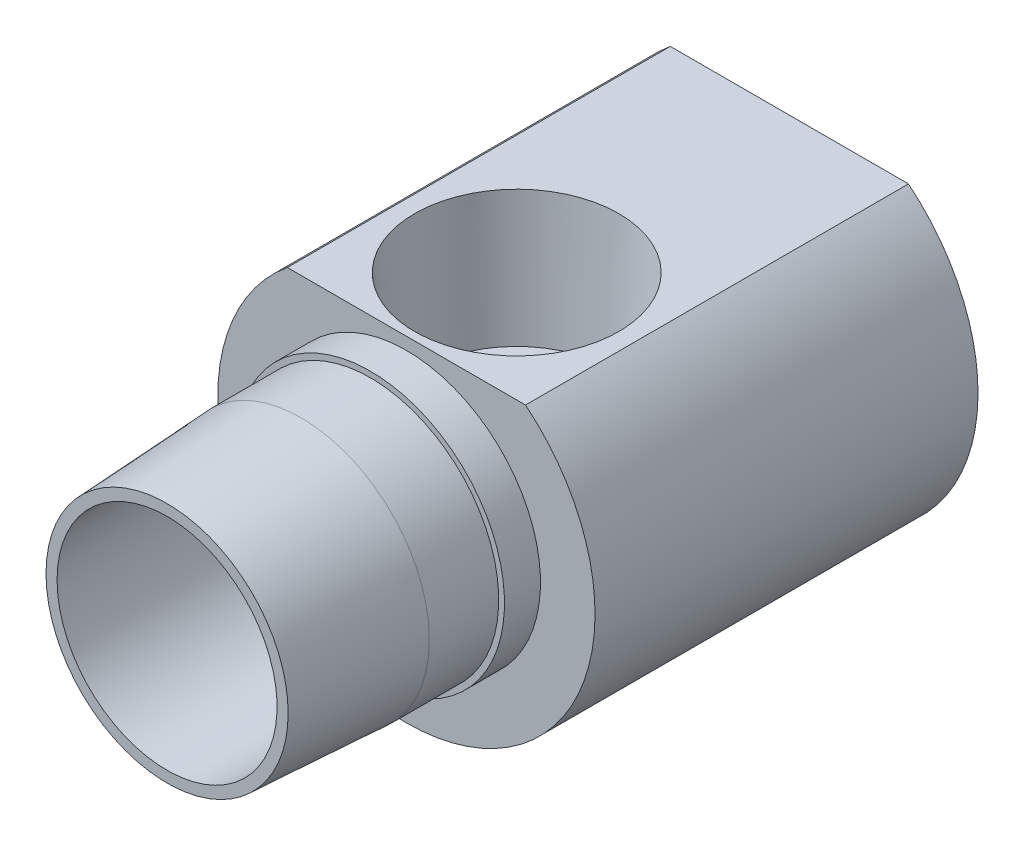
ISO-10303-21;
HEADER;
FILE_DESCRIPTION(('STEP AP214'),'2;1');
FILE_NAME('part.step','',(''),(''),'','','');
FILE_SCHEMA(('AUTOMOTIVE_DESIGN { 1 0 10303 214 1 1 1 1 }'));
ENDSEC;
DATA;
#1=APPLICATION_CONTEXT('core data for automotive mechanical design processes');
#2=APPLICATION_PROTOCOL_DEFINITION('international standard','automotive_design',2000,#1);
#3=PRODUCT_CONTEXT('',#1,'mechanical');
#4=PRODUCT('Part','Part','',(#3));
#5=PRODUCT_RELATED_PRODUCT_CATEGORY('part','',(#4));
#6=PRODUCT_DEFINITION_FORMATION('','',#4);
#7=PRODUCT_DEFINITION_CONTEXT('part definition',#1,'design');
#8=PRODUCT_DEFINITION('design','',#6,#7);
#9=PRODUCT_DEFINITION_SHAPE('','',#8);
#10=(LENGTH_UNIT() NAMED_UNIT(*) SI_UNIT(.MILLI.,.METRE.));
#11=(NAMED_UNIT(*) PLANE_ANGLE_UNIT() SI_UNIT($,.RADIAN.));
#12=(NAMED_UNIT(*) SI_UNIT($,.STERADIAN.) SOLID_ANGLE_UNIT());
#13=UNCERTAINTY_MEASURE_WITH_UNIT(LENGTH_MEASURE(1.E-05),#10,'distance_accuracy_value','');
#14=(GEOMETRIC_REPRESENTATION_CONTEXT(3) GLOBAL_UNCERTAINTY_ASSIGNED_CONTEXT((#13)) GLOBAL_UNIT_ASSIGNED_CONTEXT((#10,
#11,#12)) REPRESENTATION_CONTEXT('',''));
#15=CARTESIAN_POINT('',(0.,0.,0.));
#16=DIRECTION('',(0.,0.,1.));
#17=DIRECTION('',(1.,0.,0.));
#18=AXIS2_PLACEMENT_3D('',#15,#16,#17);
#19=CARTESIAN_POINT('',(-7.29488,0.,-13.462));
#20=DIRECTION('',(0.,0.,1.));
#21=DIRECTION('',(1.,0.,0.));
#22=AXIS2_PLACEMENT_3D('',#19,#20,#21);
#23=PLANE('',#22);
#24=CARTESIAN_POINT('',(0.,0.,-13.462));
#25=DIRECTION('',(0.,0.,-1.));
#26=DIRECTION('',(-1.,0.,0.));
#27=AXIS2_PLACEMENT_3D('',#24,#25,#26);
#28=CIRCLE('',#27,7.29488);
#29=CARTESIAN_POINT('',(-7.29488,0.,-13.462));
#30=VERTEX_POINT('',#29);
#31=EDGE_CURVE('E261',#30,#30,#28,.T.);
#32=ORIENTED_EDGE('',*,*,#31,.F.);
#33=EDGE_LOOP('',(#32));
#34=FACE_BOUND('',#33,.T.);
#35=CARTESIAN_POINT('',(0.,0.233282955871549,-13.462));
#36=DIRECTION('',(0.,0.,1.));
#37=DIRECTION('',(0.,1.,0.));
#38=AXIS2_PLACEMENT_3D('',#35,#36,#37);
#39=ELLIPSE('',#38,5.59241597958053,4.80582945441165);
#40=CARTESIAN_POINT('',(0.,5.82569893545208,-13.462));
#41=VERTEX_POINT('',#40);
#42=EDGE_CURVE('E264',#41,#41,#39,.F.);
#43=ORIENTED_EDGE('',*,*,#42,.T.);
#44=EDGE_LOOP('',(#43));
#45=FACE_BOUND('',#44,.T.);
#46=ADVANCED_FACE('F16',(#34,#45),#23,.T.);
#47=CARTESIAN_POINT('',(0.,0.,-8.89));
#48=DIRECTION('',(0.,0.,-1.));
#49=DIRECTION('',(-1.,0.,0.));
#50=AXIS2_PLACEMENT_3D('',#47,#48,#49);
#51=CONICAL_SURFACE('',#50,8.509,0.0538619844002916);
#52=CARTESIAN_POINT('',(0.,0.,0.));
#53=DIRECTION('',(0.,0.,-1.));
#54=DIRECTION('',(-1.,0.,0.));
#55=AXIS2_PLACEMENT_3D('',#52,#53,#54);
#56=CIRCLE('',#55,8.02970337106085);
#57=CARTESIAN_POINT('',(-8.02970337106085,0.,0.));
#58=VERTEX_POINT('',#57);
#59=EDGE_CURVE('E258',#58,#58,#56,.T.);
#60=ORIENTED_EDGE('',*,*,#59,.T.);
#61=EDGE_LOOP('',(#60));
#62=FACE_BOUND('',#61,.T.);
#63=CARTESIAN_POINT('',(0.,0.,-8.89));
#64=DIRECTION('',(0.,0.,-1.));
#65=DIRECTION('',(-1.,0.,0.));
#66=AXIS2_PLACEMENT_3D('',#63,#64,#65);
#67=CIRCLE('',#66,8.509);
#68=CARTESIAN_POINT('',(-8.509,0.,-8.89));
#69=VERTEX_POINT('',#68);
#70=EDGE_CURVE('E463',#69,#69,#67,.T.);
#71=ORIENTED_EDGE('',*,*,#70,.F.);
#72=EDGE_LOOP('',(#71));
#73=FACE_BOUND('',#72,.T.);
#74=ADVANCED_FACE('F18',(#62,#73),#51,.T.);
#75=CARTESIAN_POINT('',(-7.29488,0.,0.));
#76=DIRECTION('',(0.,0.,1.));
#77=DIRECTION('',(1.,0.,0.));
#78=AXIS2_PLACEMENT_3D('',#75,#76,#77);
#79=PLANE('',#78);
#80=CARTESIAN_POINT('',(0.,0.,0.));
#81=DIRECTION('',(0.,0.,-1.));
#82=DIRECTION('',(-1.,0.,0.));
#83=AXIS2_PLACEMENT_3D('',#80,#81,#82);
#84=CIRCLE('',#83,7.29488);
#85=CARTESIAN_POINT('',(-7.29488,0.,0.));
#86=VERTEX_POINT('',#85);
#87=EDGE_CURVE('E255',#86,#86,#84,.T.);
#88=ORIENTED_EDGE('',*,*,#87,.T.);
#89=EDGE_LOOP('',(#88));
#90=FACE_BOUND('',#89,.T.);
#91=ORIENTED_EDGE('',*,*,#59,.F.);
#92=EDGE_LOOP('',(#91));
#93=FACE_BOUND('',#92,.T.);
#94=ADVANCED_FACE('F242',(#90,#93),#79,.T.);
#95=CARTESIAN_POINT('',(0.,0.,-75.1971669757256));
#96=DIRECTION('',(0.,0.,-1.));
#97=DIRECTION('',(-1.,0.,0.));
#98=AXIS2_PLACEMENT_3D('',#95,#96,#97);
#99=CYLINDRICAL_SURFACE('',#98,7.29488);
#100=ORIENTED_EDGE('',*,*,#31,.T.);
#101=EDGE_LOOP('',(#100));
#102=FACE_BOUND('',#101,.T.);
#103=ORIENTED_EDGE('',*,*,#87,.F.);
#104=EDGE_LOOP('',(#103));
#105=FACE_BOUND('',#104,.T.);
#106=ADVANCED_FACE('F236',(#102,#105),#99,.F.);
#107=CARTESIAN_POINT('',(-12.5095,0.,-41.275));
#108=DIRECTION('',(0.,0.,-1.));
#109=DIRECTION('',(-1.,0.,0.));
#110=AXIS2_PLACEMENT_3D('',#107,#108,#109);
#111=PLANE('',#110);
#112=DIRECTION('',(1.,0.,0.));
#113=VECTOR('',#112,1.);
#114=CARTESIAN_POINT('',(-3.66617420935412,6.35,-41.275));
#115=LINE('',#114,#113);
#116=CARTESIAN_POINT('',(-3.66617420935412,6.35,-41.275));
#117=VERTEX_POINT('',#116);
#118=CARTESIAN_POINT('',(3.66617420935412,6.35,-41.275));
#119=VERTEX_POINT('',#118);
#120=EDGE_CURVE('E43',#117,#119,#115,.T.);
#121=ORIENTED_EDGE('',*,*,#120,.F.);
#122=DIRECTION('',(0.5,0.866025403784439,0.));
#123=VECTOR('',#122,1.);
#124=CARTESIAN_POINT('',(-7.33234841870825,0.,-41.275));
#125=LINE('',#124,#123);
#126=CARTESIAN_POINT('',(-7.33234841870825,0.,-41.275));
#127=VERTEX_POINT('',#126);
#128=EDGE_CURVE('E481',#127,#117,#125,.T.);
#129=ORIENTED_EDGE('',*,*,#128,.F.);
#130=DIRECTION('',(-0.5,0.866025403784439,0.));
#131=VECTOR('',#130,1.);
#132=CARTESIAN_POINT('',(-3.66617420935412,-6.35,-41.275));
#133=LINE('',#132,#131);
#134=CARTESIAN_POINT('',(-3.66617420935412,-6.35,-41.275));
#135=VERTEX_POINT('',#134);
#136=EDGE_CURVE('E485',#135,#127,#133,.T.);
#137=ORIENTED_EDGE('',*,*,#136,.F.);
#138=DIRECTION('',(-1.,0.,0.));
#139=VECTOR('',#138,1.);
#140=CARTESIAN_POINT('',(3.66617420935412,-6.35,-41.275));
#141=LINE('',#140,#139);
#142=CARTESIAN_POINT('',(3.66617420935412,-6.35,-41.275));
#143=VERTEX_POINT('',#142);
#144=EDGE_CURVE('E488',#143,#135,#141,.T.);
#145=ORIENTED_EDGE('',*,*,#144,.F.);
#146=DIRECTION('',(-0.5,-0.866025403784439,0.));
#147=VECTOR('',#146,1.);
#148=CARTESIAN_POINT('',(7.33234841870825,0.,-41.275));
#149=LINE('',#148,#147);
#150=CARTESIAN_POINT('',(7.33234841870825,0.,-41.275));
#151=VERTEX_POINT('',#150);
#152=EDGE_CURVE('E491',#151,#143,#149,.T.);
#153=ORIENTED_EDGE('',*,*,#152,.F.);
#154=DIRECTION('',(0.5,-0.866025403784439,0.));
#155=VECTOR('',#154,1.);
#156=CARTESIAN_POINT('',(3.66617420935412,6.35,-41.275));
#157=LINE('',#156,#155);
#158=EDGE_CURVE('E268',#119,#151,#157,.T.);
#159=ORIENTED_EDGE('',*,*,#158,.F.);
#160=EDGE_LOOP('',(#121,#129,#137,#145,#153,#159));
#161=FACE_BOUND('',#160,.T.);
#162=DIRECTION('',(-1.,0.,0.));
#163=VECTOR('',#162,1.);
#164=CARTESIAN_POINT('',(-7.8994,9.69984896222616,-41.275));
#165=LINE('',#164,#163);
#166=CARTESIAN_POINT('',(7.8994,9.69984896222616,-41.275));
#167=VERTEX_POINT('',#166);
#168=CARTESIAN_POINT('',(-7.8994,9.69984896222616,-41.275));
#169=VERTEX_POINT('',#168);
#170=EDGE_CURVE('E445',#167,#169,#165,.T.);
#171=ORIENTED_EDGE('',*,*,#170,.F.);
#172=CARTESIAN_POINT('',(0.,0.,-41.275));
#173=DIRECTION('',(0.,0.,-1.));
#174=DIRECTION('',(-1.,0.,0.));
#175=AXIS2_PLACEMENT_3D('',#172,#173,#174);
#176=CIRCLE('',#175,12.5095);
#177=EDGE_CURVE('E444',#167,#169,#176,.T.);
#178=ORIENTED_EDGE('',*,*,#177,.T.);
#179=EDGE_LOOP('',(#171,#178));
#180=FACE_BOUND('',#179,.T.);
#181=ADVANCED_FACE('F232',(#161,#180),#111,.T.);
#182=CARTESIAN_POINT('',(0.,0.,-75.1971669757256));
#183=DIRECTION('',(0.,0.,-1.));
#184=DIRECTION('',(-1.,0.,0.));
#185=AXIS2_PLACEMENT_3D('',#182,#183,#184);
#186=CYLINDRICAL_SURFACE('',#185,12.5095);
#187=DIRECTION('',(0.,0.,-1.));
#188=VECTOR('',#187,1.);
#189=CARTESIAN_POINT('',(-7.8994,9.69984896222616,0.));
#190=LINE('',#189,#188);
#191=CARTESIAN_POINT('',(-7.8994,9.69984896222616,-15.875));
#192=VERTEX_POINT('',#191);
#193=EDGE_CURVE('E438',#192,#169,#190,.T.);
#194=ORIENTED_EDGE('',*,*,#193,.T.);
#195=ORIENTED_EDGE('',*,*,#177,.F.);
#196=DIRECTION('',(0.,0.,-1.));
#197=VECTOR('',#196,1.);
#198=CARTESIAN_POINT('',(7.8994,9.69984896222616,0.));
#199=LINE('',#198,#197);
#200=CARTESIAN_POINT('',(7.8994,9.69984896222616,-15.875));
#201=VERTEX_POINT('',#200);
#202=EDGE_CURVE('E435',#201,#167,#199,.T.);
#203=ORIENTED_EDGE('',*,*,#202,.F.);
#204=CARTESIAN_POINT('',(0.,0.,-15.875));
#205=DIRECTION('',(0.,0.,-1.));
#206=DIRECTION('',(-1.,0.,0.));
#207=AXIS2_PLACEMENT_3D('',#204,#205,#206);
#208=CIRCLE('',#207,12.5095);
#209=EDGE_CURVE('E442',#201,#192,#208,.T.);
#210=ORIENTED_EDGE('',*,*,#209,.T.);
#211=EDGE_LOOP('',(#194,#195,#203,#210));
#212=FACE_BOUND('',#211,.T.);
#213=ADVANCED_FACE('F228',(#212),#186,.T.);
#214=CARTESIAN_POINT('',(-8.89,0.,-15.875));
#215=DIRECTION('',(0.,0.,1.));
#216=DIRECTION('',(1.,0.,0.));
#217=AXIS2_PLACEMENT_3D('',#214,#215,#216);
#218=PLANE('',#217);
#219=DIRECTION('',(1.,0.,0.));
#220=VECTOR('',#219,1.);
#221=CARTESIAN_POINT('',(-8.89,9.69984896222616,-15.875));
#222=LINE('',#221,#220);
#223=EDGE_CURVE('E117',#192,#201,#222,.T.);
#224=ORIENTED_EDGE('',*,*,#223,.F.);
#225=ORIENTED_EDGE('',*,*,#209,.F.);
#226=EDGE_LOOP('',(#224,#225));
#227=FACE_BOUND('',#226,.T.);
#228=CARTESIAN_POINT('',(0.,0.,-15.875));
#229=DIRECTION('',(0.,0.,-1.));
#230=DIRECTION('',(-1.,0.,0.));
#231=AXIS2_PLACEMENT_3D('',#228,#229,#230);
#232=CIRCLE('',#231,8.89);
#233=CARTESIAN_POINT('',(-8.89,0.,-15.875));
#234=VERTEX_POINT('',#233);
#235=EDGE_CURVE('E448',#234,#234,#232,.T.);
#236=ORIENTED_EDGE('',*,*,#235,.T.);
#237=EDGE_LOOP('',(#236));
#238=FACE_BOUND('',#237,.T.);
#239=ADVANCED_FACE('F224',(#227,#238),#218,.T.);
#240=CARTESIAN_POINT('',(0.,0.,-75.1971669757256));
#241=DIRECTION('',(0.,0.,-1.));
#242=DIRECTION('',(-1.,0.,0.));
#243=AXIS2_PLACEMENT_3D('',#240,#241,#242);
#244=CYLINDRICAL_SURFACE('',#243,8.89);
#245=CARTESIAN_POINT('',(0.,0.,-13.4874));
#246=DIRECTION('',(0.,0.,-1.));
#247=DIRECTION('',(-1.,0.,0.));
#248=AXIS2_PLACEMENT_3D('',#245,#246,#247);
#249=CIRCLE('',#248,8.89);
#250=CARTESIAN_POINT('',(-8.89,0.,-13.4874));
#251=VERTEX_POINT('',#250);
#252=EDGE_CURVE('E452',#251,#251,#249,.T.);
#253=ORIENTED_EDGE('',*,*,#252,.T.);
#254=EDGE_LOOP('',(#253));
#255=FACE_BOUND('',#254,.T.);
#256=ORIENTED_EDGE('',*,*,#235,.F.);
#257=EDGE_LOOP('',(#256));
#258=FACE_BOUND('',#257,.T.);
#259=ADVANCED_FACE('F220',(#255,#258),#244,.T.);
#260=CARTESIAN_POINT('',(-8.509,0.,-13.4874));
#261=DIRECTION('',(0.,0.,1.));
#262=DIRECTION('',(1.,0.,0.));
#263=AXIS2_PLACEMENT_3D('',#260,#261,#262);
#264=PLANE('',#263);
#265=CARTESIAN_POINT('',(0.,0.,-13.4874));
#266=DIRECTION('',(0.,0.,-1.));
#267=DIRECTION('',(-1.,0.,0.));
#268=AXIS2_PLACEMENT_3D('',#265,#266,#267);
#269=CIRCLE('',#268,8.509);
#270=CARTESIAN_POINT('',(-8.509,0.,-13.4874));
#271=VERTEX_POINT('',#270);
#272=EDGE_CURVE('E460',#271,#271,#269,.T.);
#273=ORIENTED_EDGE('',*,*,#272,.T.);
#274=EDGE_LOOP('',(#273));
#275=FACE_BOUND('',#274,.T.);
#276=ORIENTED_EDGE('',*,*,#252,.F.);
#277=EDGE_LOOP('',(#276));
#278=FACE_BOUND('',#277,.T.);
#279=ADVANCED_FACE('F216',(#275,#278),#264,.T.);
#280=CARTESIAN_POINT('',(0.,0.,-75.1971669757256));
#281=DIRECTION('',(0.,0.,-1.));
#282=DIRECTION('',(-1.,0.,0.));
#283=AXIS2_PLACEMENT_3D('',#280,#281,#282);
#284=CYLINDRICAL_SURFACE('',#283,8.509);
#285=ORIENTED_EDGE('',*,*,#70,.T.);
#286=EDGE_LOOP('',(#285));
#287=FACE_BOUND('',#286,.T.);
#288=ORIENTED_EDGE('',*,*,#272,.F.);
#289=EDGE_LOOP('',(#288));
#290=FACE_BOUND('',#289,.T.);
#291=ADVANCED_FACE('F212',(#287,#290),#284,.T.);
#292=CARTESIAN_POINT('',(-7.8994,9.69984896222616,0.));
#293=DIRECTION('',(0.,-1.,0.));
#294=DIRECTION('',(0.,0.,-1.));
#295=AXIS2_PLACEMENT_3D('',#292,#293,#294);
#296=PLANE('',#295);
#297=CARTESIAN_POINT('',(0.,9.69984896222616,-23.1902));
#298=DIRECTION('',(0.,-1.,0.));
#299=DIRECTION('',(0.,0.,-1.));
#300=AXIS2_PLACEMENT_3D('',#297,#298,#299);
#301=CIRCLE('',#300,6.774788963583);
#302=CARTESIAN_POINT('',(0.,9.69984896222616,-29.964988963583));
#303=VERTEX_POINT('',#302);
#304=EDGE_CURVE('E125',#303,#303,#301,.T.);
#305=ORIENTED_EDGE('',*,*,#304,.T.);
#306=EDGE_LOOP('',(#305));
#307=FACE_BOUND('',#306,.T.);
#308=ORIENTED_EDGE('',*,*,#223,.T.);
#309=ORIENTED_EDGE('',*,*,#202,.T.);
#310=ORIENTED_EDGE('',*,*,#170,.T.);
#311=ORIENTED_EDGE('',*,*,#193,.F.);
#312=EDGE_LOOP('',(#308,#309,#310,#311));
#313=FACE_BOUND('',#312,.T.);
#314=ADVANCED_FACE('F209',(#307,#313),#296,.F.);
#315=CARTESIAN_POINT('',(-3.66617420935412,6.35,-34.925));
#316=DIRECTION('',(0.,1.,0.));
#317=DIRECTION('',(-1.,0.,0.));
#318=AXIS2_PLACEMENT_3D('',#315,#316,#317);
#319=PLANE('',#318);
#320=ORIENTED_EDGE('',*,*,#120,.T.);
#321=DIRECTION('',(0.,0.,-1.));
#322=VECTOR('',#321,1.);
#323=CARTESIAN_POINT('',(3.66617420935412,6.35,-34.925));
#324=LINE('',#323,#322);
#325=CARTESIAN_POINT('',(3.66617420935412,6.35,-34.925));
#326=VERTEX_POINT('',#325);
#327=EDGE_CURVE('E469',#326,#119,#324,.T.);
#328=ORIENTED_EDGE('',*,*,#327,.F.);
#329=DIRECTION('',(1.,0.,0.));
#330=VECTOR('',#329,1.);
#331=CARTESIAN_POINT('',(-3.66617420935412,6.35,-34.925));
#332=LINE('',#331,#330);
#333=CARTESIAN_POINT('',(-3.66617420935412,6.35,-34.925));
#334=VERTEX_POINT('',#333);
#335=EDGE_CURVE('E484',#334,#326,#332,.T.);
#336=ORIENTED_EDGE('',*,*,#335,.F.);
#337=DIRECTION('',(0.,0.,-1.));
#338=VECTOR('',#337,1.);
#339=CARTESIAN_POINT('',(-3.66617420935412,6.35,-34.925));
#340=LINE('',#339,#338);
#341=EDGE_CURVE('E468',#334,#117,#340,.T.);
#342=ORIENTED_EDGE('',*,*,#341,.T.);
#343=EDGE_LOOP('',(#320,#328,#336,#342));
#344=FACE_BOUND('',#343,.T.);
#345=ADVANCED_FACE('F191',(#344),#319,.F.);
#346=CARTESIAN_POINT('',(-7.33234841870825,0.,-34.925));
#347=DIRECTION('',(-0.866025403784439,0.5,0.));
#348=DIRECTION('',(-0.5,-0.866025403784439,0.));
#349=AXIS2_PLACEMENT_3D('',#346,#347,#348);
#350=PLANE('',#349);
#351=ORIENTED_EDGE('',*,*,#128,.T.);
#352=ORIENTED_EDGE('',*,*,#341,.F.);
#353=DIRECTION('',(0.5,0.866025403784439,0.));
#354=VECTOR('',#353,1.);
#355=CARTESIAN_POINT('',(-7.33234841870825,0.,-34.925));
#356=LINE('',#355,#354);
#357=CARTESIAN_POINT('',(-7.33234841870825,0.,-34.925));
#358=VERTEX_POINT('',#357);
#359=EDGE_CURVE('E472',#358,#334,#356,.T.);
#360=ORIENTED_EDGE('',*,*,#359,.F.);
#361=DIRECTION('',(0.,0.,-1.));
#362=VECTOR('',#361,1.);
#363=CARTESIAN_POINT('',(-7.33234841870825,0.,-34.925));
#364=LINE('',#363,#362);
#365=EDGE_CURVE('E478',#358,#127,#364,.T.);
#366=ORIENTED_EDGE('',*,*,#365,.T.);
#367=EDGE_LOOP('',(#351,#352,#360,#366));
#368=FACE_BOUND('',#367,.T.);
#369=ADVANCED_FACE('F187',(#368),#350,.F.);
#370=CARTESIAN_POINT('',(-3.66617420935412,-6.35,-34.925));
#371=DIRECTION('',(-0.866025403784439,-0.5,0.));
#372=DIRECTION('',(0.5,-0.866025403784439,0.));
#373=AXIS2_PLACEMENT_3D('',#370,#371,#372);
#374=PLANE('',#373);
#375=ORIENTED_EDGE('',*,*,#136,.T.);
#376=ORIENTED_EDGE('',*,*,#365,.F.);
#377=DIRECTION('',(-0.5,0.866025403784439,0.));
#378=VECTOR('',#377,1.);
#379=CARTESIAN_POINT('',(-3.66617420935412,-6.35,-34.925));
#380=LINE('',#379,#378);
#381=CARTESIAN_POINT('',(-3.66617420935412,-6.35,-34.925));
#382=VERTEX_POINT('',#381);
#383=EDGE_CURVE('E498',#382,#358,#380,.T.);
#384=ORIENTED_EDGE('',*,*,#383,.F.);
#385=DIRECTION('',(0.,0.,-1.));
#386=VECTOR('',#385,1.);
#387=CARTESIAN_POINT('',(-3.66617420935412,-6.35,-34.925));
#388=LINE('',#387,#386);
#389=EDGE_CURVE('E476',#382,#135,#388,.T.);
#390=ORIENTED_EDGE('',*,*,#389,.T.);
#391=EDGE_LOOP('',(#375,#376,#384,#390));
#392=FACE_BOUND('',#391,.T.);
#393=ADVANCED_FACE('F190',(#392),#374,.F.);
#394=CARTESIAN_POINT('',(3.66617420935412,-6.35,-34.925));
#395=DIRECTION('',(0.,-1.,0.));
#396=DIRECTION('',(1.,0.,0.));
#397=AXIS2_PLACEMENT_3D('',#394,#395,#396);
#398=PLANE('',#397);
#399=ORIENTED_EDGE('',*,*,#144,.T.);
#400=ORIENTED_EDGE('',*,*,#389,.F.);
#401=DIRECTION('',(-1.,0.,0.));
#402=VECTOR('',#401,1.);
#403=CARTESIAN_POINT('',(3.66617420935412,-6.35,-34.925));
#404=LINE('',#403,#402);
#405=CARTESIAN_POINT('',(3.66617420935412,-6.35,-34.925));
#406=VERTEX_POINT('',#405);
#407=EDGE_CURVE('E501',#406,#382,#404,.T.);
#408=ORIENTED_EDGE('',*,*,#407,.F.);
#409=DIRECTION('',(0.,0.,-1.));
#410=VECTOR('',#409,1.);
#411=CARTESIAN_POINT('',(3.66617420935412,-6.35,-34.925));
#412=LINE('',#411,#410);
#413=EDGE_CURVE('E474',#406,#143,#412,.T.);
#414=ORIENTED_EDGE('',*,*,#413,.T.);
#415=EDGE_LOOP('',(#399,#400,#408,#414));
#416=FACE_BOUND('',#415,.T.);
#417=ADVANCED_FACE('F195',(#416),#398,.F.);
#418=CARTESIAN_POINT('',(7.33234841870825,0.,-34.925));
#419=DIRECTION('',(0.866025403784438,-0.5,0.));
#420=DIRECTION('',(0.5,0.866025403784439,0.));
#421=AXIS2_PLACEMENT_3D('',#418,#419,#420);
#422=PLANE('',#421);
#423=ORIENTED_EDGE('',*,*,#152,.T.);
#424=ORIENTED_EDGE('',*,*,#413,.F.);
#425=DIRECTION('',(-0.5,-0.866025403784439,0.));
#426=VECTOR('',#425,1.);
#427=CARTESIAN_POINT('',(7.33234841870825,0.,-34.925));
#428=LINE('',#427,#426);
#429=CARTESIAN_POINT('',(7.33234841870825,0.,-34.925));
#430=VERTEX_POINT('',#429);
#431=EDGE_CURVE('E504',#430,#406,#428,.T.);
#432=ORIENTED_EDGE('',*,*,#431,.F.);
#433=DIRECTION('',(0.,0.,-1.));
#434=VECTOR('',#433,1.);
#435=CARTESIAN_POINT('',(7.33234841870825,0.,-34.925));
#436=LINE('',#435,#434);
#437=EDGE_CURVE('E471',#430,#151,#436,.T.);
#438=ORIENTED_EDGE('',*,*,#437,.T.);
#439=EDGE_LOOP('',(#423,#424,#432,#438));
#440=FACE_BOUND('',#439,.T.);
#441=ADVANCED_FACE('F199',(#440),#422,.F.);
#442=CARTESIAN_POINT('',(3.66617420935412,6.35,-34.925));
#443=DIRECTION('',(0.866025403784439,0.5,0.));
#444=DIRECTION('',(-0.5,0.866025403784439,0.));
#445=AXIS2_PLACEMENT_3D('',#442,#443,#444);
#446=PLANE('',#445);
#447=ORIENTED_EDGE('',*,*,#158,.T.);
#448=ORIENTED_EDGE('',*,*,#437,.F.);
#449=DIRECTION('',(0.5,-0.866025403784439,0.));
#450=VECTOR('',#449,1.);
#451=CARTESIAN_POINT('',(3.66617420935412,6.35,-34.925));
#452=LINE('',#451,#450);
#453=EDGE_CURVE('E507',#326,#430,#452,.T.);
#454=ORIENTED_EDGE('',*,*,#453,.F.);
#455=ORIENTED_EDGE('',*,*,#327,.T.);
#456=EDGE_LOOP('',(#447,#448,#454,#455));
#457=FACE_BOUND('',#456,.T.);
#458=ADVANCED_FACE('F185',(#457),#446,.F.);
#459=CARTESIAN_POINT('',(0.,0.,-34.925));
#460=DIRECTION('',(0.,0.,-1.));
#461=DIRECTION('',(-1.,0.,0.));
#462=AXIS2_PLACEMENT_3D('',#459,#460,#461);
#463=PLANE('',#462);
#464=ORIENTED_EDGE('',*,*,#335,.T.);
#465=ORIENTED_EDGE('',*,*,#453,.T.);
#466=ORIENTED_EDGE('',*,*,#431,.T.);
#467=ORIENTED_EDGE('',*,*,#407,.T.);
#468=ORIENTED_EDGE('',*,*,#383,.T.);
#469=ORIENTED_EDGE('',*,*,#359,.T.);
#470=EDGE_LOOP('',(#464,#465,#466,#467,#468,#469));
#471=FACE_BOUND('',#470,.T.);
#472=ADVANCED_FACE('F181',(#471),#463,.T.);
#473=CARTESIAN_POINT('',(0.,-6.00581530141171,-22.9455880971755));
#474=DIRECTION('',(0.,0.493966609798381,0.869480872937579));
#475=DIRECTION('',(0.,-0.869480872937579,0.493966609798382));
#476=AXIS2_PLACEMENT_3D('',#473,#474,#475);
#477=CONICAL_SURFACE('',#476,1.8272494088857,1.04024469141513);
#478=CARTESIAN_POINT('',(-1.82744940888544,-5.03807735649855,-23.3149062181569));
#479=CARTESIAN_POINT('',(-1.7867215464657,-5.06094159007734,-23.3299883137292));
#480=CARTESIAN_POINT('',(-1.74593824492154,-5.0836922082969,-23.3450942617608));
#481=CARTESIAN_POINT('',(-1.66422690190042,-5.1289025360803,-23.3753594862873));
#482=CARTESIAN_POINT('',(-1.62329885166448,-5.15136222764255,-23.390518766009));
#483=CARTESIAN_POINT('',(-1.50006110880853,-5.21831012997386,-23.4361537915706));
#484=CARTESIAN_POINT('',(-1.41748938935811,-5.26225884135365,-23.46671571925));
#485=CARTESIAN_POINT('',(-1.24868945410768,-5.34917568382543,-23.5290319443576));
#486=CARTESIAN_POINT('',(-1.16242670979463,-5.39207254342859,-23.5607940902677));
#487=CARTESIAN_POINT('',(-1.03156273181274,-5.45317848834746,-23.6084355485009));
#488=CARTESIAN_POINT('',(-0.987715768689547,-5.47299934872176,-23.6243088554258));
#489=CARTESIAN_POINT('',(-0.899357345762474,-5.51118722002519,-23.6559453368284));
#490=CARTESIAN_POINT('',(-0.854845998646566,-5.52955447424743,-23.6717085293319));
#491=CARTESIAN_POINT('',(-0.76921296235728,-5.56271504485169,-23.7014228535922));
#492=CARTESIAN_POINT('',(-0.728169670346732,-5.57768209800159,-23.7154041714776));
#493=CARTESIAN_POINT('',(-0.645195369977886,-5.60561336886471,-23.7427706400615));
#494=CARTESIAN_POINT('',(-0.603264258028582,-5.61857735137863,-23.7561557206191));
#495=CARTESIAN_POINT('',(-0.518641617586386,-5.641986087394,-23.7816928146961));
#496=CARTESIAN_POINT('',(-0.475956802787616,-5.65244666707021,-23.7938522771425));
#497=CARTESIAN_POINT('',(-0.389494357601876,-5.67061749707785,-23.8162115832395));
#498=CARTESIAN_POINT('',(-0.34571709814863,-5.67832866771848,-23.8264120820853));
#499=CARTESIAN_POINT('',(-0.266721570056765,-5.68951680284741,-23.841947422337));
#500=CARTESIAN_POINT('',(-0.231696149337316,-5.69354850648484,-23.8478572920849));
#501=CARTESIAN_POINT('',(-0.16117435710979,-5.69986270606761,-23.8573615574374));
#502=CARTESIAN_POINT('',(-0.125678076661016,-5.70214553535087,-23.8609563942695));
#503=CARTESIAN_POINT('',(-0.054543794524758,-5.70500060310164,-23.865486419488));
#504=CARTESIAN_POINT('',(-0.0189064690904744,-5.70557761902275,-23.8664290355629));
#505=CARTESIAN_POINT('',(0.0523250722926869,-5.70505066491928,-23.8655808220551));
#506=CARTESIAN_POINT('',(0.0879192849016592,-5.70394657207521,-23.8637897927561));
#507=CARTESIAN_POINT('',(0.158494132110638,-5.70004503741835,-23.8576776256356));
#508=CARTESIAN_POINT('',(0.19347740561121,-5.69726160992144,-23.85337743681));
#509=CARTESIAN_POINT('',(0.262928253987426,-5.68997359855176,-23.8426456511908));
#510=CARTESIAN_POINT('',(0.297395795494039,-5.68546890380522,-23.8362139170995));
#511=CARTESIAN_POINT('',(0.366093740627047,-5.67467661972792,-23.8216177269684));
#512=CARTESIAN_POINT('',(0.400316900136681,-5.66836919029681,-23.8134342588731));
#513=CARTESIAN_POINT('',(0.468079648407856,-5.65407475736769,-23.7958669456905));
#514=CARTESIAN_POINT('',(0.501619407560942,-5.64608817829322,-23.7864834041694));
#515=CARTESIAN_POINT('',(0.594678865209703,-5.6215681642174,-23.7591031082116));
#516=CARTESIAN_POINT('',(0.653484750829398,-5.603313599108,-23.7402287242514));
#517=CARTESIAN_POINT('',(0.769466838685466,-5.56301798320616,-23.7014874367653));
#518=CARTESIAN_POINT('',(0.826641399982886,-5.5409732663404,-23.681619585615));
#519=CARTESIAN_POINT('',(0.94004012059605,-5.49412082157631,-23.6414953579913));
#520=CARTESIAN_POINT('',(0.99625857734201,-5.46930064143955,-23.621237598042));
#521=CARTESIAN_POINT('',(1.10780540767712,-5.41781838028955,-23.5807131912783));
#522=CARTESIAN_POINT('',(1.16313409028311,-5.39115695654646,-23.5604465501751));
#523=CARTESIAN_POINT('',(1.26994740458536,-5.33814574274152,-23.5211792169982));
#524=CARTESIAN_POINT('',(1.32146709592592,-5.31186946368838,-23.5021740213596));
#525=CARTESIAN_POINT('',(1.42411095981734,-5.25848290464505,-23.4642532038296));
#526=CARTESIAN_POINT('',(1.47523509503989,-5.23137254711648,-23.4453375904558));
#527=CARTESIAN_POINT('',(1.57666925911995,-5.17681631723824,-23.4077887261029));
#528=CARTESIAN_POINT('',(1.62698228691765,-5.14937663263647,-23.3891545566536));
#529=CARTESIAN_POINT('',(1.72737333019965,-5.09403821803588,-23.3519703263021));
#530=CARTESIAN_POINT('',(1.77745138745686,-5.06613957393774,-23.3334202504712));
#531=CARTESIAN_POINT('',(1.82744940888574,-5.0380773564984,-23.3149062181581));
#532=B_SPLINE_CURVE_WITH_KNOTS('',3,(#478,#479,#480,#481,#482,#483,#484,#485,#486,#487,#488,
#489,#490,#491,#492,#493,#494,#495,#496,#497,#498,#499,#500,#501,#502,#503,#504,#505,#506,#507,
#508,#509,#510,#511,#512,#513,#514,#515,#516,#517,#518,#519,#520,#521,#522,#523,#524,#525,#526,
#527,#528,#529,#530,#531),.UNSPECIFIED.,.F.,.F.,(4,2,2,2,2,2,2,2,2,2,2,2,2,2,2,2,2,2,2,2,2,2,2,
2,2,2,4),(0.,0.147245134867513,0.29449933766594,0.589701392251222,0.893945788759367,
1.04593617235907,1.1979010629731,1.33546836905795,1.47305181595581,1.60974103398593,
1.74638445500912,1.85352454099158,1.960644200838,2.06746356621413,2.17429073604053,
2.28023851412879,2.38619311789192,2.49336194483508,2.600503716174,2.79348380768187,
2.98665162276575,3.18072377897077,3.37472701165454,3.55734659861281,3.7399832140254,
3.920768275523,4.10151987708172),.UNSPECIFIED.);
#533=CARTESIAN_POINT('',(-1.56363388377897,-5.18375827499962,-23.4126124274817));
#534=VERTEX_POINT('',#533);
#535=CARTESIAN_POINT('',(1.56363388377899,-5.18375827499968,-23.4126124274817));
#536=VERTEX_POINT('',#535);
#537=EDGE_CURVE('E167',#534,#536,#532,.T.);
#538=ORIENTED_EDGE('',*,*,#537,.F.);
#539=CARTESIAN_POINT('',(0.,-6.00581530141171,-22.9455880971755));
#540=DIRECTION('',(0.,-0.493966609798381,-0.869480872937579));
#541=DIRECTION('',(0.,0.869480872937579,-0.493966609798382));
#542=AXIS2_PLACEMENT_3D('',#539,#540,#541);
#543=CIRCLE('',#542,1.8272494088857);
#544=EDGE_CURVE('E173',#536,#534,#543,.T.);
#545=ORIENTED_EDGE('',*,*,#544,.F.);
#546=EDGE_LOOP('',(#538,#545));
#547=FACE_BOUND('',#546,.T.);
#548=CARTESIAN_POINT('',(0.,-6.53533316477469,-23.8776463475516));
#549=VERTEX_POINT('',#548);
#550=VERTEX_LOOP('',#549);
#551=FACE_BOUND('',#550,.T.);
#552=ADVANCED_FACE('F177',(#547,#551),#477,.F.);
#553=CARTESIAN_POINT('',(0.,0.989120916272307,-10.6330893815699));
#554=DIRECTION('',(0.,0.493966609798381,0.869480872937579));
#555=DIRECTION('',(0.,-0.869480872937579,0.493966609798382));
#556=AXIS2_PLACEMENT_3D('',#553,#554,#555);
#557=CONICAL_SURFACE('',#556,5.62161014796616,0.261799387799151);
#558=CARTESIAN_POINT('',(1.31407249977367,-5.24708172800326,-23.8483882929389));
#559=CARTESIAN_POINT('',(1.33999010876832,-5.24369445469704,-23.8097611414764));
#560=CARTESIAN_POINT('',(1.36498705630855,-5.23965924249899,-23.7705905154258));
#561=CARTESIAN_POINT('',(1.41330462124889,-5.23024588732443,-23.6914104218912));
#562=CARTESIAN_POINT('',(1.43662603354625,-5.22486838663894,-23.6514013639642));
#563=CARTESIAN_POINT('',(1.50420195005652,-5.20668868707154,-23.5307141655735));
#564=CARTESIAN_POINT('',(1.54624684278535,-5.19181625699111,-23.4491026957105));
#565=CARTESIAN_POINT('',(1.62526155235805,-5.15692729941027,-23.2858158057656));
#566=CARTESIAN_POINT('',(1.66228545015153,-5.13697360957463,-23.2041525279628));
#567=CARTESIAN_POINT('',(1.71530330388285,-5.10356374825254,-23.0815055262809));
#568=CARTESIAN_POINT('',(1.7325630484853,-5.09184152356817,-23.040580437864));
#569=CARTESIAN_POINT('',(1.76635510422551,-5.0673308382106,-22.9587507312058));
#570=CARTESIAN_POINT('',(1.78288744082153,-5.05454241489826,-22.9178461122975));
#571=CARTESIAN_POINT('',(1.83057234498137,-5.01552544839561,-22.7977226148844));
#572=CARTESIAN_POINT('',(1.86087317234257,-4.98795453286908,-22.71860067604));
#573=CARTESIAN_POINT('',(1.91978108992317,-4.9298301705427,-22.5608156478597));
#574=CARTESIAN_POINT('',(1.94838776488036,-4.89927599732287,-22.4821526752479));
#575=CARTESIAN_POINT('',(2.0043784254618,-4.83575630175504,-22.3252883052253));
#576=CARTESIAN_POINT('',(2.03176137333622,-4.80278879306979,-22.2470873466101));
#577=CARTESIAN_POINT('',(2.08560507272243,-4.73494501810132,-22.0911946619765));
#578=CARTESIAN_POINT('',(2.11206574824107,-4.70006859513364,-22.0135029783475));
#579=CARTESIAN_POINT('',(2.19057305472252,-4.59298364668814,-21.7807033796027));
#580=CARTESIAN_POINT('',(2.24159462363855,-4.51849785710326,-21.6262997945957));
#581=CARTESIAN_POINT('',(2.3420488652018,-4.36567705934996,-21.3190112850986));
#582=CARTESIAN_POINT('',(2.39148225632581,-4.28734383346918,-21.1661256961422));
#583=CARTESIAN_POINT('',(2.49004661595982,-4.1269836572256,-20.8593452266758));
#584=CARTESIAN_POINT('',(2.53916436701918,-4.04492099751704,-20.7054648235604));
#585=CARTESIAN_POINT('',(2.6367682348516,-3.87893598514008,-20.3984913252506));
#586=CARTESIAN_POINT('',(2.68525428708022,-3.7950134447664,-20.245398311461));
#587=CARTESIAN_POINT('',(2.78172802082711,-3.62596665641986,-19.9400324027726));
#588=CARTESIAN_POINT('',(2.82971632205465,-3.54084432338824,-19.7877586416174));
#589=CARTESIAN_POINT('',(2.92539484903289,-3.369628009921,-19.4836643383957));
#590=CARTESIAN_POINT('',(2.97308507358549,-3.28353402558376,-19.3318437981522));
#591=CARTESIAN_POINT('',(3.04900074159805,-3.14558942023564,-19.0899011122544));
#592=CARTESIAN_POINT('',(3.07729576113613,-3.09397563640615,-18.9996655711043));
#593=CARTESIAN_POINT('',(3.133684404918,-2.99077406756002,-18.8197397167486));
#594=CARTESIAN_POINT('',(3.16177834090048,-2.93918736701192,-18.7300488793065));
#595=CARTESIAN_POINT('',(3.18984619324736,-2.88750711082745,-18.6404038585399));
#596=B_SPLINE_CURVE_WITH_KNOTS('',3,(#558,#559,#560,#561,#562,#563,#564,#565,#566,#567,#568,
#569,#570,#571,#572,#573,#574,#575,#576,#577,#578,#579,#580,#581,#582,#583,#584,#585,#586,#587,
#588,#589,#590,#591,#592,#593,#594,#595),.UNSPECIFIED.,.F.,.F.,(4,2,2,2,2,2,2,2,2,2,2,2,2,2,2,2,
2,2,4),(0.,0.139879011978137,0.279691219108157,0.558337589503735,0.833692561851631,
0.971487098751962,1.10927680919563,1.37647813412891,1.64374468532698,1.91123374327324,
2.17874478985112,2.71523041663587,3.25146982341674,3.79498947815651,4.33856423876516,
4.88135231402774,5.42414256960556,5.74735027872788,6.06899283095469),.UNSPECIFIED.);
#597=CARTESIAN_POINT('',(3.18973757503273,-2.88770711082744,-18.6407507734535));
#598=VERTEX_POINT('',#597);
#599=EDGE_CURVE('E10',#536,#598,#596,.T.);
#600=ORIENTED_EDGE('',*,*,#599,.F.);
#601=ORIENTED_EDGE('',*,*,#544,.T.);
#602=CARTESIAN_POINT('',(-3.18984619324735,-2.88750711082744,-18.6404038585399));
#603=CARTESIAN_POINT('',(-3.13267735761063,-2.99272756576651,-18.8229727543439));
#604=CARTESIAN_POINT('',(-3.07541676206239,-3.09760237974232,-19.0057149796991));
#605=CARTESIAN_POINT('',(-2.96055123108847,-3.30629481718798,-19.3717871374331));
#606=CARTESIAN_POINT('',(-2.90294617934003,-3.41011204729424,-19.555117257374));
#607=CARTESIAN_POINT('',(-2.78624836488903,-3.61807100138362,-19.9257255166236));
#608=CARTESIAN_POINT('',(-2.72714731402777,-3.72218596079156,-20.1130161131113));
#609=CARTESIAN_POINT('',(-2.60819901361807,-3.9280836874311,-20.4885652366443));
#610=CARTESIAN_POINT('',(-2.54835198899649,-4.02986713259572,-20.6768234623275));
#611=CARTESIAN_POINT('',(-2.43027041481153,-4.22513500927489,-21.045814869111));
#612=CARTESIAN_POINT('',(-2.37209494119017,-4.31878377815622,-21.2264791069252));
#613=CARTESIAN_POINT('',(-2.28326157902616,-4.45543267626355,-21.499011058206));
#614=CARTESIAN_POINT('',(-2.25337314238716,-4.50036684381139,-21.5901577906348));
#615=CARTESIAN_POINT('',(-2.19288261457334,-4.58855242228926,-21.7730245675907));
#616=CARTESIAN_POINT('',(-2.16228055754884,-4.63180391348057,-21.8647445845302));
#617=CARTESIAN_POINT('',(-2.10033503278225,-4.71578660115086,-22.0481102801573));
#618=CARTESIAN_POINT('',(-2.06899954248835,-4.75653532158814,-22.1397505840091));
#619=CARTESIAN_POINT('',(-2.00494046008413,-4.83523561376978,-22.3237756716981));
#620=CARTESIAN_POINT('',(-1.97221663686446,-4.87318671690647,-22.4161605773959));
#621=CARTESIAN_POINT('',(-1.9048460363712,-4.9453595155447,-22.6014795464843));
#622=CARTESIAN_POINT('',(-1.87020287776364,-4.9795878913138,-22.6944122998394));
#623=CARTESIAN_POINT('',(-1.79807471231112,-5.04332723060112,-22.8807760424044));
#624=CARTESIAN_POINT('',(-1.76059117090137,-5.07284060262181,-22.9742067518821));
#625=CARTESIAN_POINT('',(-1.70705678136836,-5.10885891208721,-23.1006926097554));
#626=CARTESIAN_POINT('',(-1.6927921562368,-5.11791691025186,-23.1337842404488));
#627=CARTESIAN_POINT('',(-1.66367615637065,-5.13525674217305,-23.1999167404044));
#628=CARTESIAN_POINT('',(-1.6488247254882,-5.14353850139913,-23.2329576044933));
#629=CARTESIAN_POINT('',(-1.60328989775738,-5.16715333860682,-23.3319131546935));
#630=CARTESIAN_POINT('',(-1.57161951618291,-5.18126039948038,-23.3976762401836));
#631=CARTESIAN_POINT('',(-1.50477308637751,-5.20604917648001,-23.5286881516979));
#632=CARTESIAN_POINT('',(-1.46957360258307,-5.21670569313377,-23.5939299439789));
#633=CARTESIAN_POINT('',(-1.39507154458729,-5.23452117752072,-23.7227003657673));
#634=CARTESIAN_POINT('',(-1.35576028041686,-5.24167254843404,-23.7862249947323));
#635=CARTESIAN_POINT('',(-1.31407249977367,-5.24708172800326,-23.8483882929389));
#636=B_SPLINE_CURVE_WITH_KNOTS('',3,(#602,#603,#604,#605,#606,#607,#608,#609,#610,#611,#612,
#613,#614,#615,#616,#617,#618,#619,#620,#621,#622,#623,#624,#625,#626,#627,#628,#629,#630,#631,
#632,#633,#634,#635),.UNSPECIFIED.,.F.,.F.,(4,2,2,2,2,2,2,2,2,2,2,2,2,2,2,2,4),(0.,
0.655013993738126,1.31026332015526,1.97710727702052,2.64375480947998,3.27863229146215,
3.59639489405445,3.91414232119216,4.22932519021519,4.54456073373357,4.85922092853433,
5.17371987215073,5.2851776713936,5.39664616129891,5.61953128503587,5.84400924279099,
6.06897159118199),.UNSPECIFIED.);
#637=CARTESIAN_POINT('',(-3.18973757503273,-2.88770711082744,-18.6407507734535));
#638=VERTEX_POINT('',#637);
#639=EDGE_CURVE('E29',#638,#534,#636,.T.);
#640=ORIENTED_EDGE('',*,*,#639,.F.);
#641=CARTESIAN_POINT('',(-1.62976548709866,0.990799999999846,-17.8783473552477));
#642=CARTESIAN_POINT('',(-1.67697335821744,0.946112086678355,-17.892834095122));
#643=CARTESIAN_POINT('',(-1.72286142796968,0.900154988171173,-17.9075991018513));
#644=CARTESIAN_POINT('',(-1.81208826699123,0.805994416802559,-17.9375369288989));
#645=CARTESIAN_POINT('',(-1.85542819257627,0.757791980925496,-17.9527095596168));
#646=CARTESIAN_POINT('',(-1.98162530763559,0.610423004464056,-17.9985641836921));
#647=CARTESIAN_POINT('',(-2.06088122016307,0.508281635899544,-18.0296525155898));
#648=CARTESIAN_POINT('',(-2.21063355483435,0.297549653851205,-18.0920040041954));
#649=CARTESIAN_POINT('',(-2.28111116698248,0.188945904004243,-18.1232673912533));
#650=CARTESIAN_POINT('',(-2.4138164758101,-0.0334646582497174,-18.185126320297));
#651=CARTESIAN_POINT('',(-2.47603787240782,-0.147275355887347,-18.2157213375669));
#652=CARTESIAN_POINT('',(-2.60913849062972,-0.411994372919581,-18.2839406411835));
#653=CARTESIAN_POINT('',(-2.67749173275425,-0.564293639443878,-18.3211066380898));
#654=CARTESIAN_POINT('',(-2.80187896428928,-0.874715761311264,-18.3916073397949));
#655=CARTESIAN_POINT('',(-2.85791043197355,-1.03283980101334,-18.424941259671));
#656=CARTESIAN_POINT('',(-2.9576171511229,-1.35367823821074,-18.4861770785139));
#657=CARTESIAN_POINT('',(-3.0013125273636,-1.51638467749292,-18.5140878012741));
#658=CARTESIAN_POINT('',(-3.07597452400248,-1.84564415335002,-18.5628591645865));
#659=CARTESIAN_POINT('',(-3.10695109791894,-2.01219407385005,-18.5837253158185));
#660=CARTESIAN_POINT('',(-3.14786435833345,-2.2971471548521,-18.6116318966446));
#661=CARTESIAN_POINT('',(-3.16133327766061,-2.41482277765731,-18.620946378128));
#662=CARTESIAN_POINT('',(-3.1810622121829,-2.65090494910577,-18.6346700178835));
#663=CARTESIAN_POINT('',(-3.18733111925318,-2.76931041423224,-18.6390852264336));
#664=CARTESIAN_POINT('',(-3.18974160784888,-2.88790711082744,-18.6407536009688));
#665=B_SPLINE_CURVE_WITH_KNOTS('',3,(#641,#642,#643,#644,#645,#646,#647,#648,#649,#650,#651,
#652,#653,#654,#655,#656,#657,#658,#659,#660,#661,#662,#663,#664),.UNSPECIFIED.,.F.,.F.,(4,2,2,
2,2,2,2,2,2,2,2,4),(0.,0.199734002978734,0.39937665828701,0.797720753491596,1.19690424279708,
1.5963906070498,2.10882467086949,2.62136351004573,3.13306131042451,3.64435789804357,
4.00048764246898,4.35617709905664),.UNSPECIFIED.);
#666=CARTESIAN_POINT('',(-1.62997678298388,0.990599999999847,-17.8784121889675));
#667=VERTEX_POINT('',#666);
#668=EDGE_CURVE('E132',#667,#638,#665,.T.);
#669=ORIENTED_EDGE('',*,*,#668,.F.);
#670=CARTESIAN_POINT('',(0.,0.990599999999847,-3.72632467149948));
#671=DIRECTION('',(0.,-1.,0.));
#672=DIRECTION('',(0.,0.,1.));
#673=AXIS2_PLACEMENT_3D('',#670,#671,#672);
#674=ELLIPSE('',#673,14.6384816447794,6.37614469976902);
#675=CARTESIAN_POINT('',(-2.35633358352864,0.990599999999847,-17.3285338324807));
#676=VERTEX_POINT('',#675);
#677=EDGE_CURVE('E122',#676,#667,#674,.T.);
#678=ORIENTED_EDGE('',*,*,#677,.F.);
#679=CARTESIAN_POINT('',(2.35646282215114,0.990399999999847,-17.3285971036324));
#680=CARTESIAN_POINT('',(2.29776387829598,1.08118670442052,-17.2998778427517));
#681=CARTESIAN_POINT('',(2.23622207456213,1.17021605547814,-17.2711715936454));
#682=CARTESIAN_POINT('',(2.10681229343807,1.34414017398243,-17.214190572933));
#683=CARTESIAN_POINT('',(2.03892541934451,1.42902136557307,-17.185917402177));
#684=CARTESIAN_POINT('',(1.89539172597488,1.59478649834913,-17.1299427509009));
#685=CARTESIAN_POINT('',(1.81963732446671,1.67558378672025,-17.1022578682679));
#686=CARTESIAN_POINT('',(1.66093196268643,1.83022493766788,-17.0486495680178));
#687=CARTESIAN_POINT('',(1.57799060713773,1.90407781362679,-17.0227238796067));
#688=CARTESIAN_POINT('',(1.38720593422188,2.05701819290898,-16.9685193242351));
#689=CARTESIAN_POINT('',(1.27768391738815,2.13424605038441,-16.9407911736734));
#690=CARTESIAN_POINT('',(1.04800591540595,2.2721017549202,-16.8908812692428));
#691=CARTESIAN_POINT('',(0.927904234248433,2.33280850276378,-16.8686731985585));
#692=CARTESIAN_POINT('',(0.697534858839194,2.4254843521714,-16.8345936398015));
#693=CARTESIAN_POINT('',(0.588651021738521,2.46045744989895,-16.8216506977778));
#694=CARTESIAN_POINT('',(0.36608171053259,2.51278377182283,-16.8022434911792));
#695=CARTESIAN_POINT('',(0.252397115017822,2.53014020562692,-16.7957780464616));
#696=CARTESIAN_POINT('',(0.0231510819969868,2.54558857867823,-16.7900247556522));
#697=CARTESIAN_POINT('',(-0.0924151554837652,2.54361939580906,-16.7907596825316));
#698=CARTESIAN_POINT('',(-0.321322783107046,2.52046878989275,-16.7993774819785));
#699=CARTESIAN_POINT('',(-0.434663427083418,2.49928103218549,-16.8072627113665));
#700=CARTESIAN_POINT('',(-0.65092551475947,2.4410370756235,-16.8288344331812));
#701=CARTESIAN_POINT('',(-0.754086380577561,2.40474549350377,-16.842241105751));
#702=CARTESIAN_POINT('',(-0.953913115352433,2.31895367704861,-16.8737330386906));
#703=CARTESIAN_POINT('',(-1.05057710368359,2.26944963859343,-16.8918196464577));
#704=CARTESIAN_POINT('',(-1.29655223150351,2.12447449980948,-16.9443592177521));
#705=CARTESIAN_POINT('',(-1.43982986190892,2.01989425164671,-16.9818655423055));
#706=CARTESIAN_POINT('',(-1.70770440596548,1.79052525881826,-17.0626185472));
#707=CARTESIAN_POINT('',(-1.83222268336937,1.66565577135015,-17.1058880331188));
#708=CARTESIAN_POINT('',(-2.02337304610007,1.44806732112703,-17.1795506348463));
#709=CARTESIAN_POINT('',(-2.09501823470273,1.359380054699,-17.2091537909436));
#710=CARTESIAN_POINT('',(-2.23091758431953,1.17787738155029,-17.2687000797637));
#711=CARTESIAN_POINT('',(-2.29523010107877,1.08510412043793,-17.2986380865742));
#712=CARTESIAN_POINT('',(-2.35646282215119,0.990399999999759,-17.3285971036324));
#713=B_SPLINE_CURVE_WITH_KNOTS('',3,(#679,#680,#681,#682,#683,#684,#685,#686,#687,#688,#689,
#690,#691,#692,#693,#694,#695,#696,#697,#698,#699,#700,#701,#702,#703,#704,#705,#706,#707,#708,
#709,#710,#711,#712),.UNSPECIFIED.,.F.,.F.,(4,2,2,2,2,2,2,2,2,2,2,2,2,2,2,2,4),(0.,
0.33562091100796,0.672275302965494,1.01436457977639,1.35600353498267,1.76529801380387,
2.17260206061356,2.51643799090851,2.8602112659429,3.20507215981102,3.55004676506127,
3.87934947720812,4.20874710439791,4.74957912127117,5.2926186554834,5.64571363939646,
5.9957667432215),.UNSPECIFIED.);
#714=CARTESIAN_POINT('',(2.35633358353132,0.990599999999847,-17.3285338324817));
#715=VERTEX_POINT('',#714);
#716=EDGE_CURVE('E110',#715,#676,#713,.T.);
#717=ORIENTED_EDGE('',*,*,#716,.F.);
#718=CARTESIAN_POINT('',(1.62997678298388,0.990599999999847,-17.8784121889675));
#719=VERTEX_POINT('',#718);
#720=EDGE_CURVE('E116',#719,#715,#674,.T.);
#721=ORIENTED_EDGE('',*,*,#720,.F.);
#722=CARTESIAN_POINT('',(3.18974160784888,-2.88790711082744,-18.6407536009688));
#723=CARTESIAN_POINT('',(3.18679009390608,-2.74379552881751,-18.6387297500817));
#724=CARTESIAN_POINT('',(3.17817510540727,-2.59998290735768,-18.63264610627));
#725=CARTESIAN_POINT('',(3.15053701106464,-2.31401184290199,-18.6134745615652));
#726=CARTESIAN_POINT('',(3.13152806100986,-2.17185141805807,-18.6003961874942));
#727=CARTESIAN_POINT('',(3.08387298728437,-1.88904382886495,-18.5682479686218));
#728=CARTESIAN_POINT('',(3.05517273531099,-1.74840984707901,-18.5491445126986));
#729=CARTESIAN_POINT('',(2.98868454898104,-1.47002123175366,-18.5060506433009));
#730=CARTESIAN_POINT('',(2.95089291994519,-1.33226779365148,-18.4820582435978));
#731=CARTESIAN_POINT('',(2.86514900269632,-1.05590286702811,-18.4293758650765));
#732=CARTESIAN_POINT('',(2.81691120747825,-0.917404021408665,-18.4005605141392));
#733=CARTESIAN_POINT('',(2.71103183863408,-0.644733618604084,-18.3398445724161));
#734=CARTESIAN_POINT('',(2.65338975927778,-0.510562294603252,-18.3079438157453));
#735=CARTESIAN_POINT('',(2.52862317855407,-0.247823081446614,-18.2421765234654));
#736=CARTESIAN_POINT('',(2.4615345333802,-0.119236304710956,-18.208317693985));
#737=CARTESIAN_POINT('',(2.31716617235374,0.131728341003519,-18.1395514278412));
#738=CARTESIAN_POINT('',(2.23989173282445,0.254109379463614,-18.1046445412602));
#739=CARTESIAN_POINT('',(2.07955516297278,0.483625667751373,-18.0370998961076));
#740=CARTESIAN_POINT('',(1.99718112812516,0.591235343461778,-18.0044600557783));
#741=CARTESIAN_POINT('',(1.86565568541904,0.74626204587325,-17.9563273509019));
#742=CARTESIAN_POINT('',(1.82044783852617,0.796910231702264,-17.940408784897));
#743=CARTESIAN_POINT('',(1.7272327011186,0.895770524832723,-17.909007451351));
#744=CARTESIAN_POINT('',(1.67922346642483,0.943980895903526,-17.8935249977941));
#745=CARTESIAN_POINT('',(1.62976548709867,0.99079999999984,-17.8783473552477));
#746=B_SPLINE_CURVE_WITH_KNOTS('',3,(#722,#723,#724,#725,#726,#727,#728,#729,#730,#731,#732,
#733,#734,#735,#736,#737,#738,#739,#740,#741,#742,#743,#744,#745),.UNSPECIFIED.,.F.,.F.,(4,2,2,
2,2,2,2,2,2,2,2,4),(0.,0.432117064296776,0.863647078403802,1.29762829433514,1.73178617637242,
2.17978468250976,2.62780728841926,3.07417301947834,3.52030843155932,3.93785797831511,
4.14696138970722,4.35621168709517),.UNSPECIFIED.);
#747=EDGE_CURVE('E133',#598,#719,#746,.T.);
#748=ORIENTED_EDGE('',*,*,#747,.F.);
#749=EDGE_LOOP('',(#600,#601,#640,#669,#678,#717,#721,#748));
#750=FACE_BOUND('',#749,.T.);
#751=ORIENTED_EDGE('',*,*,#42,.F.);
#752=EDGE_LOOP('',(#751));
#753=FACE_BOUND('',#752,.T.);
#754=ADVANCED_FACE('F129',(#750,#753),#557,.F.);
#755=CARTESIAN_POINT('',(0.,-6.09560954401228,-23.1902));
#756=DIRECTION('',(0.,1.,0.));
#757=DIRECTION('',(0.,0.,1.));
#758=AXIS2_PLACEMENT_3D('',#755,#756,#757);
#759=CONICAL_SURFACE('',#758,0.,1.0471975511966);
#760=ORIENTED_EDGE('',*,*,#599,.T.);
#761=CARTESIAN_POINT('',(0.,-2.88770711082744,-23.1902));
#762=DIRECTION('',(0.,-1.,0.));
#763=DIRECTION('',(0.,0.,-1.));
#764=AXIS2_PLACEMENT_3D('',#761,#762,#763);
#765=CIRCLE('',#764,5.55625);
#766=EDGE_CURVE('E174',#638,#598,#765,.T.);
#767=ORIENTED_EDGE('',*,*,#766,.F.);
#768=ORIENTED_EDGE('',*,*,#639,.T.);
#769=ORIENTED_EDGE('',*,*,#537,.T.);
#770=EDGE_LOOP('',(#760,#767,#768,#769));
#771=FACE_BOUND('',#770,.T.);
#772=ADVANCED_FACE('F155',(#771),#759,.F.);
#773=CARTESIAN_POINT('',(0.,9.69984896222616,-23.1902));
#774=DIRECTION('',(0.,-1.,0.));
#775=DIRECTION('',(0.,0.,-1.));
#776=AXIS2_PLACEMENT_3D('',#773,#774,#775);
#777=CYLINDRICAL_SURFACE('',#776,5.55625);
#778=ORIENTED_EDGE('',*,*,#668,.T.);
#779=ORIENTED_EDGE('',*,*,#766,.T.);
#780=ORIENTED_EDGE('',*,*,#747,.T.);
#781=CARTESIAN_POINT('',(0.,0.990599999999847,-23.1902));
#782=DIRECTION('',(0.,-1.,0.));
#783=DIRECTION('',(0.,0.,-1.));
#784=AXIS2_PLACEMENT_3D('',#781,#782,#783);
#785=CIRCLE('',#784,5.55625);
#786=EDGE_CURVE('E124',#667,#719,#785,.T.);
#787=ORIENTED_EDGE('',*,*,#786,.F.);
#788=EDGE_LOOP('',(#778,#779,#780,#787));
#789=FACE_BOUND('',#788,.T.);
#790=ADVANCED_FACE('F151',(#789),#777,.F.);
#791=CARTESIAN_POINT('',(0.,0.990599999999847,-29.5077500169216));
#792=DIRECTION('',(0.,-1.,0.));
#793=DIRECTION('',(0.,0.,-1.));
#794=AXIS2_PLACEMENT_3D('',#791,#792,#793);
#795=PLANE('',#794);
#796=ORIENTED_EDGE('',*,*,#677,.T.);
#797=ORIENTED_EDGE('',*,*,#786,.T.);
#798=ORIENTED_EDGE('',*,*,#720,.T.);
#799=CARTESIAN_POINT('',(0.,0.990599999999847,-23.1902));
#800=DIRECTION('',(0.,-1.,0.));
#801=DIRECTION('',(0.,0.,-1.));
#802=AXIS2_PLACEMENT_3D('',#799,#800,#801);
#803=CIRCLE('',#802,6.31755001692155);
#804=EDGE_CURVE('E35',#676,#715,#803,.T.);
#805=ORIENTED_EDGE('',*,*,#804,.F.);
#806=EDGE_LOOP('',(#796,#797,#798,#805));
#807=FACE_BOUND('',#806,.T.);
#808=ADVANCED_FACE('F120',(#807),#795,.F.);
#809=CARTESIAN_POINT('',(0.,0.990599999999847,-23.1902));
#810=DIRECTION('',(0.,1.,0.));
#811=DIRECTION('',(0.,0.,1.));
#812=AXIS2_PLACEMENT_3D('',#809,#810,#811);
#813=CONICAL_SURFACE('',#812,6.31755001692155,0.052452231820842);
#814=ORIENTED_EDGE('',*,*,#716,.T.);
#815=ORIENTED_EDGE('',*,*,#804,.T.);
#816=EDGE_LOOP('',(#814,#815));
#817=FACE_BOUND('',#816,.T.);
#818=ORIENTED_EDGE('',*,*,#304,.F.);
#819=EDGE_LOOP('',(#818));
#820=FACE_BOUND('',#819,.T.);
#821=ADVANCED_FACE('F111',(#817,#820),#813,.F.);
#822=CLOSED_SHELL('',(#46,#74,#94,#106,#181,#213,#239,#259,#279,#291,#314,#345,#369,#393,#417,
#441,#458,#472,#552,#754,#772,#790,#808,#821));
#823=MANIFOLD_SOLID_BREP('B1',#822);
#824=ADVANCED_BREP_SHAPE_REPRESENTATION('',(#18,#823),#14);
#825=SHAPE_DEFINITION_REPRESENTATION(#9,#824);
ENDSEC;
END-ISO-10303-21;
